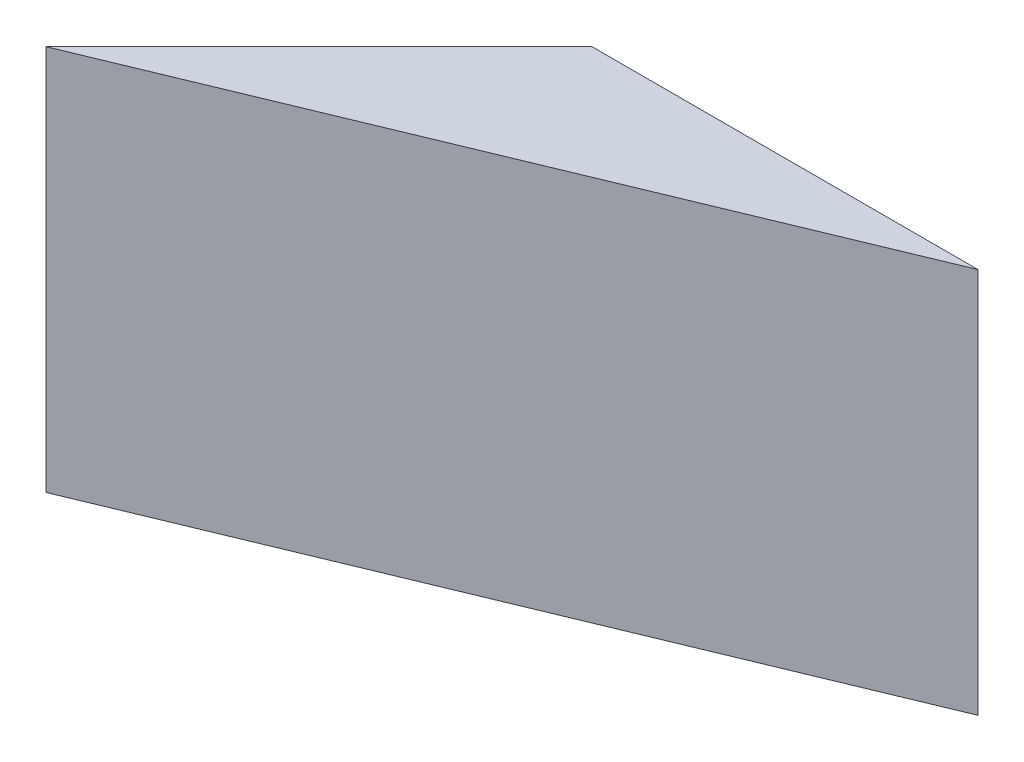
ISO-10303-21;
HEADER;
FILE_DESCRIPTION(('STEP AP214'),'2;1');
FILE_NAME('part.step','',(''),(''),'','','');
FILE_SCHEMA(('AUTOMOTIVE_DESIGN { 1 0 10303 214 1 1 1 1 }'));
ENDSEC;
DATA;
#1=APPLICATION_CONTEXT('core data for automotive mechanical design processes');
#2=APPLICATION_PROTOCOL_DEFINITION('international standard','automotive_design',2000,#1);
#3=PRODUCT_CONTEXT('',#1,'mechanical');
#4=PRODUCT('Part','Part','',(#3));
#5=PRODUCT_RELATED_PRODUCT_CATEGORY('part','',(#4));
#6=PRODUCT_DEFINITION_FORMATION('','',#4);
#7=PRODUCT_DEFINITION_CONTEXT('part definition',#1,'design');
#8=PRODUCT_DEFINITION('design','',#6,#7);
#9=PRODUCT_DEFINITION_SHAPE('','',#8);
#10=(LENGTH_UNIT() NAMED_UNIT(*) SI_UNIT(.MILLI.,.METRE.));
#11=(NAMED_UNIT(*) PLANE_ANGLE_UNIT() SI_UNIT($,.RADIAN.));
#12=(NAMED_UNIT(*) SI_UNIT($,.STERADIAN.) SOLID_ANGLE_UNIT());
#13=UNCERTAINTY_MEASURE_WITH_UNIT(LENGTH_MEASURE(1.E-05),#10,'distance_accuracy_value','');
#14=(GEOMETRIC_REPRESENTATION_CONTEXT(3) GLOBAL_UNCERTAINTY_ASSIGNED_CONTEXT((#13)) GLOBAL_UNIT_ASSIGNED_CONTEXT((#10,
#11,#12)) REPRESENTATION_CONTEXT('',''));
#15=CARTESIAN_POINT('',(0.,0.,0.));
#16=DIRECTION('',(0.,0.,1.));
#17=DIRECTION('',(1.,0.,0.));
#18=AXIS2_PLACEMENT_3D('',#15,#16,#17);
#19=CARTESIAN_POINT('',(0.,60.,0.));
#20=DIRECTION('',(0.707106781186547,0.,0.707106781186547));
#21=DIRECTION('',(0.707106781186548,0.,-0.707106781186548));
#22=AXIS2_PLACEMENT_3D('',#19,#20,#21);
#23=PLANE('',#22);
#24=DIRECTION('',(-0.707106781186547,0.,0.707106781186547));
#25=VECTOR('',#24,1.);
#26=CARTESIAN_POINT('',(0.,0.,0.));
#27=LINE('',#26,#25);
#28=CARTESIAN_POINT('',(0.,0.,0.));
#29=VERTEX_POINT('',#28);
#30=CARTESIAN_POINT('',(-42.4264068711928,0.,42.4264068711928));
#31=VERTEX_POINT('',#30);
#32=EDGE_CURVE('E92',#29,#31,#27,.T.);
#33=ORIENTED_EDGE('',*,*,#32,.T.);
#34=DIRECTION('',(0.,-1.,0.));
#35=VECTOR('',#34,1.);
#36=CARTESIAN_POINT('',(-42.4264068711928,60.,42.4264068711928));
#37=LINE('',#36,#35);
#38=CARTESIAN_POINT('',(-42.4264068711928,60.,42.4264068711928));
#39=VERTEX_POINT('',#38);
#40=EDGE_CURVE('E11',#39,#31,#37,.T.);
#41=ORIENTED_EDGE('',*,*,#40,.F.);
#42=DIRECTION('',(-0.707106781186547,0.,0.707106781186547));
#43=VECTOR('',#42,1.);
#44=CARTESIAN_POINT('',(0.,60.,0.));
#45=LINE('',#44,#43);
#46=CARTESIAN_POINT('',(0.,60.,0.));
#47=VERTEX_POINT('',#46);
#48=EDGE_CURVE('E85',#47,#39,#45,.T.);
#49=ORIENTED_EDGE('',*,*,#48,.F.);
#50=DIRECTION('',(0.,-1.,0.));
#51=VECTOR('',#50,1.);
#52=CARTESIAN_POINT('',(0.,60.,0.));
#53=LINE('',#52,#51);
#54=EDGE_CURVE('E93',#47,#29,#53,.T.);
#55=ORIENTED_EDGE('',*,*,#54,.T.);
#56=EDGE_LOOP('',(#33,#41,#49,#55));
#57=FACE_BOUND('',#56,.T.);
#58=ADVANCED_FACE('F45',(#57),#23,.F.);
#59=CARTESIAN_POINT('',(-42.4264068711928,60.,42.4264068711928));
#60=DIRECTION('',(-0.38268343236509,0.,-0.923879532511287));
#61=DIRECTION('',(-0.923879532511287,0.,0.38268343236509));
#62=AXIS2_PLACEMENT_3D('',#59,#60,#61);
#63=PLANE('',#62);
#64=DIRECTION('',(0.923879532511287,0.,-0.38268343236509));
#65=VECTOR('',#64,1.);
#66=CARTESIAN_POINT('',(-42.4264068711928,0.,42.4264068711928));
#67=LINE('',#66,#65);
#68=CARTESIAN_POINT('',(60.,0.,0.));
#69=VERTEX_POINT('',#68);
#70=EDGE_CURVE('E73',#31,#69,#67,.T.);
#71=ORIENTED_EDGE('',*,*,#70,.T.);
#72=DIRECTION('',(0.,-1.,0.));
#73=VECTOR('',#72,1.);
#74=CARTESIAN_POINT('',(60.,60.,0.));
#75=LINE('',#74,#73);
#76=CARTESIAN_POINT('',(60.,60.,0.));
#77=VERTEX_POINT('',#76);
#78=EDGE_CURVE('E53',#77,#69,#75,.T.);
#79=ORIENTED_EDGE('',*,*,#78,.F.);
#80=DIRECTION('',(0.923879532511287,0.,-0.38268343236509));
#81=VECTOR('',#80,1.);
#82=CARTESIAN_POINT('',(-42.4264068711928,60.,42.4264068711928));
#83=LINE('',#82,#81);
#84=EDGE_CURVE('E81',#39,#77,#83,.T.);
#85=ORIENTED_EDGE('',*,*,#84,.F.);
#86=ORIENTED_EDGE('',*,*,#40,.T.);
#87=EDGE_LOOP('',(#71,#79,#85,#86));
#88=FACE_BOUND('',#87,.T.);
#89=ADVANCED_FACE('F82',(#88),#63,.F.);
#90=CARTESIAN_POINT('',(0.,60.,0.));
#91=DIRECTION('',(0.,0.,1.));
#92=DIRECTION('',(1.,0.,0.));
#93=AXIS2_PLACEMENT_3D('',#90,#91,#92);
#94=PLANE('',#93);
#95=DIRECTION('',(-1.,0.,0.));
#96=VECTOR('',#95,1.);
#97=CARTESIAN_POINT('',(0.,0.,0.));
#98=LINE('',#97,#96);
#99=EDGE_CURVE('E78',#69,#29,#98,.T.);
#100=ORIENTED_EDGE('',*,*,#99,.T.);
#101=ORIENTED_EDGE('',*,*,#54,.F.);
#102=DIRECTION('',(-1.,0.,0.));
#103=VECTOR('',#102,1.);
#104=CARTESIAN_POINT('',(0.,60.,0.));
#105=LINE('',#104,#103);
#106=EDGE_CURVE('E61',#77,#47,#105,.T.);
#107=ORIENTED_EDGE('',*,*,#106,.F.);
#108=ORIENTED_EDGE('',*,*,#78,.T.);
#109=EDGE_LOOP('',(#100,#101,#107,#108));
#110=FACE_BOUND('',#109,.T.);
#111=ADVANCED_FACE('F100',(#110),#94,.F.);
#112=CARTESIAN_POINT('',(0.,60.,0.));
#113=DIRECTION('',(0.,1.,0.));
#114=DIRECTION('',(0.,0.,1.));
#115=AXIS2_PLACEMENT_3D('',#112,#113,#114);
#116=PLANE('',#115);
#117=ORIENTED_EDGE('',*,*,#48,.T.);
#118=ORIENTED_EDGE('',*,*,#84,.T.);
#119=ORIENTED_EDGE('',*,*,#106,.T.);
#120=EDGE_LOOP('',(#117,#118,#119));
#121=FACE_BOUND('',#120,.T.);
#122=ADVANCED_FACE('F88',(#121),#116,.T.);
#123=CARTESIAN_POINT('',(0.,0.,0.));
#124=DIRECTION('',(0.,1.,0.));
#125=DIRECTION('',(0.,0.,1.));
#126=AXIS2_PLACEMENT_3D('',#123,#124,#125);
#127=PLANE('',#126);
#128=ORIENTED_EDGE('',*,*,#32,.F.);
#129=ORIENTED_EDGE('',*,*,#99,.F.);
#130=ORIENTED_EDGE('',*,*,#70,.F.);
#131=EDGE_LOOP('',(#128,#129,#130));
#132=FACE_BOUND('',#131,.T.);
#133=ADVANCED_FACE('F101',(#132),#127,.F.);
#134=CLOSED_SHELL('',(#58,#89,#111,#122,#133));
#135=MANIFOLD_SOLID_BREP('B2',#134);
#136=ADVANCED_BREP_SHAPE_REPRESENTATION('',(#18,#135),#14);
#137=SHAPE_DEFINITION_REPRESENTATION(#9,#136);
ENDSEC;
END-ISO-10303-21;
